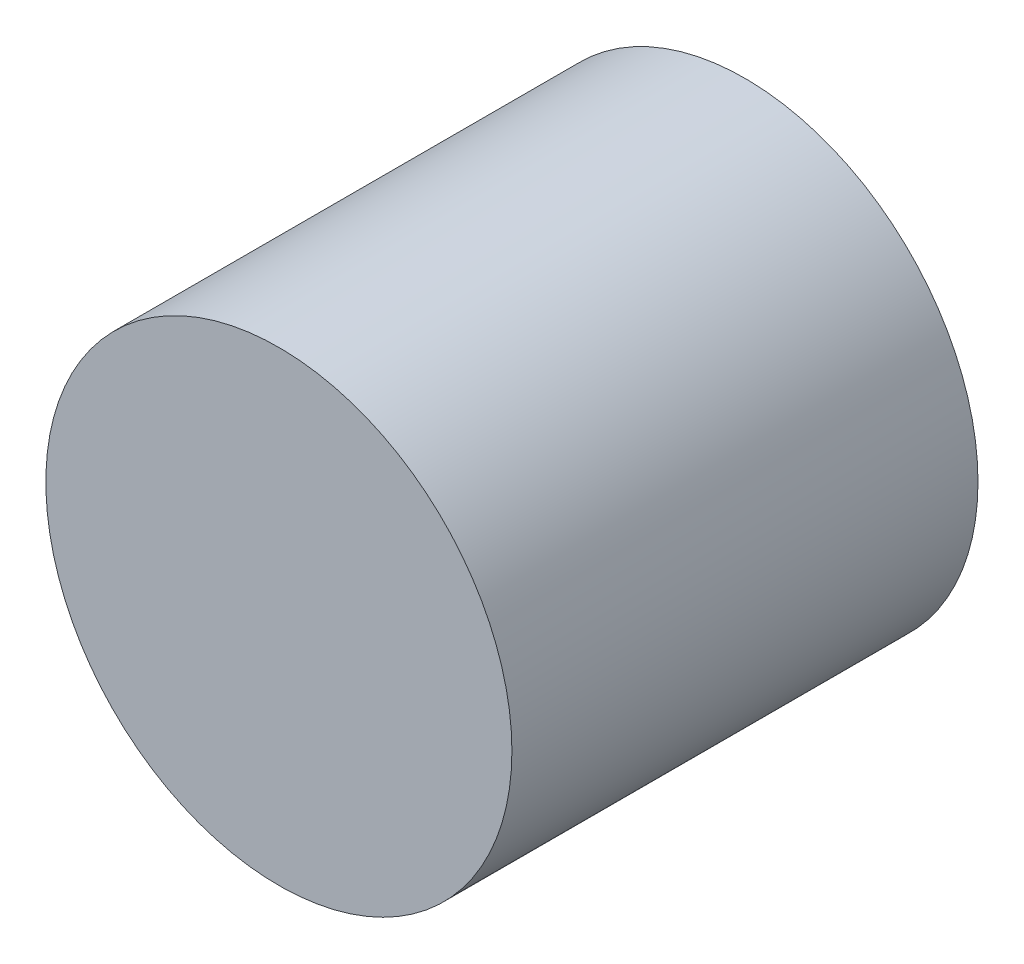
from build123d import *

# Parameters (mm, degrees)
EXTRUDE1_DEPTH      = 10
EXTRUDE1_DEPTH_BACK = 10
SKETCH1_R           = 10


with BuildPart() as part:
    # Sketch1 → Extrude1 (new, two sides: drawn at the far end of the back side and taken through both)
    with BuildSketch(Plane.XY.offset(-EXTRUDE1_DEPTH_BACK)):
        Circle(SKETCH1_R)
    extrude(amount=EXTRUDE1_DEPTH + EXTRUDE1_DEPTH_BACK)


solid = part.part
